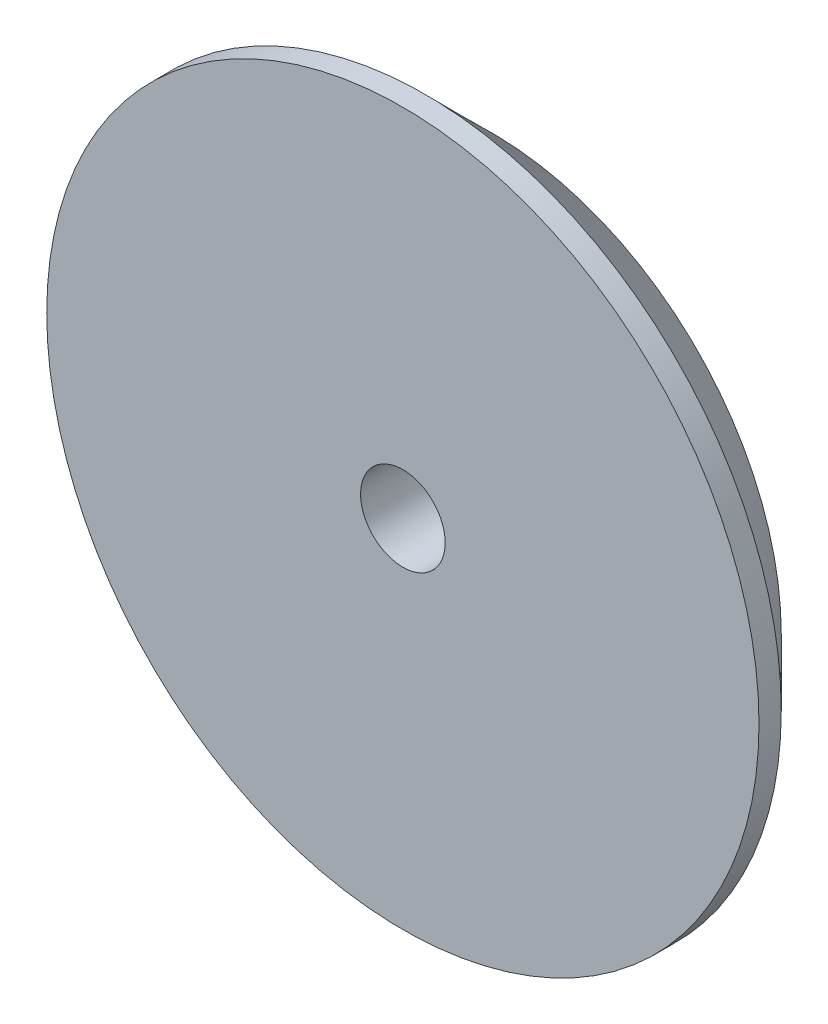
from build123d import *

# Parameters (mm, degrees)
ESQUISSE1_R      = 8
ESQUISSE1_R_2    = 0.95
EXTRUSION1_DEPTH = 2
CHANFREIN1_SIZE  = 1.5


with BuildPart() as part:
    # Esquisse1 → Extrusion1 (new body)
    with BuildSketch(Plane.XY):
        Circle(ESQUISSE1_R)
        Circle(ESQUISSE1_R_2, mode=Mode.SUBTRACT)
    extrude(amount=EXTRUSION1_DEPTH)

    # Chanfrein1
    chanfrein1_edges = [part.edges().sort_by_distance(p)[0] for p in [
        (-8, 0, 0),
    ]]
    chamfer(chanfrein1_edges, length=CHANFREIN1_SIZE)


solid = part.part
